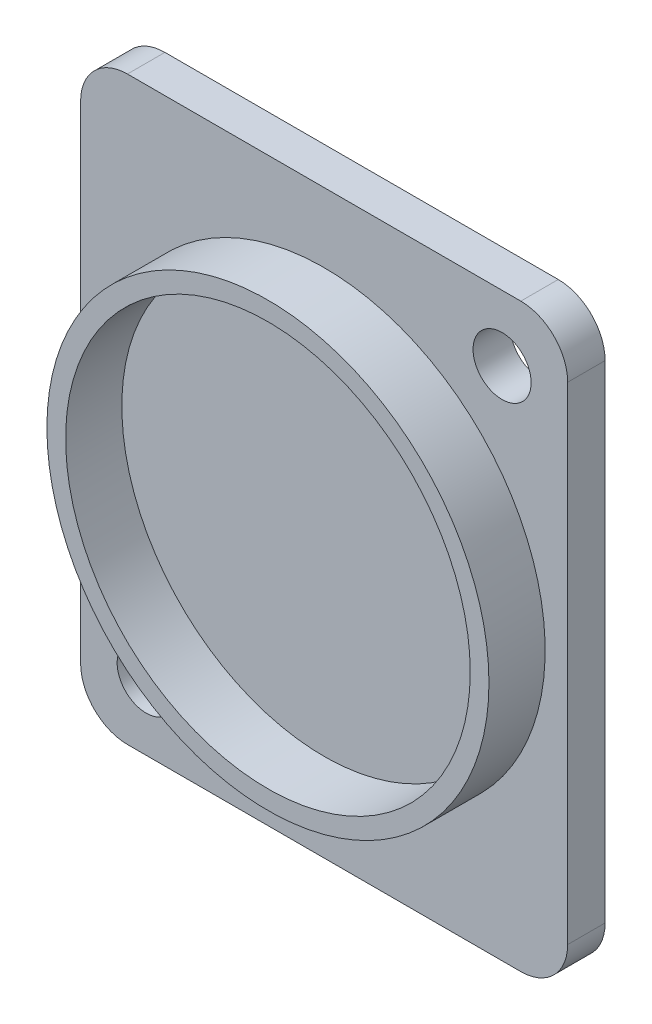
ISO-10303-21;
HEADER;
FILE_DESCRIPTION(('STEP AP214'),'2;1');
FILE_NAME('part.step','',(''),(''),'','','');
FILE_SCHEMA(('AUTOMOTIVE_DESIGN { 1 0 10303 214 1 1 1 1 }'));
ENDSEC;
DATA;
#1=APPLICATION_CONTEXT('core data for automotive mechanical design processes');
#2=APPLICATION_PROTOCOL_DEFINITION('international standard','automotive_design',2000,#1);
#3=PRODUCT_CONTEXT('',#1,'mechanical');
#4=PRODUCT('Part','Part','',(#3));
#5=PRODUCT_RELATED_PRODUCT_CATEGORY('part','',(#4));
#6=PRODUCT_DEFINITION_FORMATION('','',#4);
#7=PRODUCT_DEFINITION_CONTEXT('part definition',#1,'design');
#8=PRODUCT_DEFINITION('design','',#6,#7);
#9=PRODUCT_DEFINITION_SHAPE('','',#8);
#10=(LENGTH_UNIT() NAMED_UNIT(*) SI_UNIT(.MILLI.,.METRE.));
#11=(NAMED_UNIT(*) PLANE_ANGLE_UNIT() SI_UNIT($,.RADIAN.));
#12=(NAMED_UNIT(*) SI_UNIT($,.STERADIAN.) SOLID_ANGLE_UNIT());
#13=UNCERTAINTY_MEASURE_WITH_UNIT(LENGTH_MEASURE(1.E-05),#10,'distance_accuracy_value','');
#14=(GEOMETRIC_REPRESENTATION_CONTEXT(3) GLOBAL_UNCERTAINTY_ASSIGNED_CONTEXT((#13)) GLOBAL_UNIT_ASSIGNED_CONTEXT((#10,
#11,#12)) REPRESENTATION_CONTEXT('',''));
#15=CARTESIAN_POINT('',(0.,0.,0.));
#16=DIRECTION('',(0.,0.,1.));
#17=DIRECTION('',(1.,0.,0.));
#18=AXIS2_PLACEMENT_3D('',#15,#16,#17);
#19=CARTESIAN_POINT('',(-10.5,-13.,2.));
#20=DIRECTION('',(0.,0.,-1.));
#21=DIRECTION('',(-1.,0.,0.));
#22=AXIS2_PLACEMENT_3D('',#19,#20,#21);
#23=PLANE('',#22);
#24=CARTESIAN_POINT('',(9.5,12.,2.));
#25=DIRECTION('',(0.,0.,1.));
#26=DIRECTION('',(1.,0.,0.));
#27=AXIS2_PLACEMENT_3D('',#24,#25,#26);
#28=CIRCLE('',#27,1.55);
#29=CARTESIAN_POINT('',(11.05,12.,2.));
#30=VERTEX_POINT('',#29);
#31=EDGE_CURVE('E135',#30,#30,#28,.T.);
#32=ORIENTED_EDGE('',*,*,#31,.F.);
#33=EDGE_LOOP('',(#32));
#34=FACE_BOUND('',#33,.T.);
#35=CARTESIAN_POINT('',(-10.5,-13.,2.));
#36=DIRECTION('',(0.,0.,1.));
#37=DIRECTION('',(-1.,0.,0.));
#38=AXIS2_PLACEMENT_3D('',#35,#36,#37);
#39=CIRCLE('',#38,2.5);
#40=CARTESIAN_POINT('',(-13.,-13.,2.));
#41=VERTEX_POINT('',#40);
#42=CARTESIAN_POINT('',(-10.5,-15.5,2.));
#43=VERTEX_POINT('',#42);
#44=EDGE_CURVE('E146',#41,#43,#39,.T.);
#45=ORIENTED_EDGE('',*,*,#44,.T.);
#46=DIRECTION('',(1.,0.,0.));
#47=VECTOR('',#46,1.);
#48=CARTESIAN_POINT('',(10.5,-15.5,2.));
#49=LINE('',#48,#47);
#50=CARTESIAN_POINT('',(10.5,-15.5,2.));
#51=VERTEX_POINT('',#50);
#52=EDGE_CURVE('E94',#43,#51,#49,.T.);
#53=ORIENTED_EDGE('',*,*,#52,.T.);
#54=CARTESIAN_POINT('',(10.5,-13.,2.));
#55=DIRECTION('',(0.,0.,1.));
#56=DIRECTION('',(1.,0.,0.));
#57=AXIS2_PLACEMENT_3D('',#54,#55,#56);
#58=CIRCLE('',#57,2.5);
#59=CARTESIAN_POINT('',(13.,-13.,2.));
#60=VERTEX_POINT('',#59);
#61=EDGE_CURVE('E178',#51,#60,#58,.T.);
#62=ORIENTED_EDGE('',*,*,#61,.T.);
#63=DIRECTION('',(0.,1.,0.));
#64=VECTOR('',#63,1.);
#65=CARTESIAN_POINT('',(13.,-13.,2.));
#66=LINE('',#65,#64);
#67=CARTESIAN_POINT('',(13.,13.,2.));
#68=VERTEX_POINT('',#67);
#69=EDGE_CURVE('E177',#60,#68,#66,.T.);
#70=ORIENTED_EDGE('',*,*,#69,.T.);
#71=CARTESIAN_POINT('',(10.5,13.,2.));
#72=DIRECTION('',(0.,0.,1.));
#73=DIRECTION('',(1.,0.,0.));
#74=AXIS2_PLACEMENT_3D('',#71,#72,#73);
#75=CIRCLE('',#74,2.5);
#76=CARTESIAN_POINT('',(10.5,15.5,2.));
#77=VERTEX_POINT('',#76);
#78=EDGE_CURVE('E113',#68,#77,#75,.T.);
#79=ORIENTED_EDGE('',*,*,#78,.T.);
#80=DIRECTION('',(-1.,0.,0.));
#81=VECTOR('',#80,1.);
#82=CARTESIAN_POINT('',(10.5,15.5,2.));
#83=LINE('',#82,#81);
#84=CARTESIAN_POINT('',(-10.5,15.5,2.));
#85=VERTEX_POINT('',#84);
#86=EDGE_CURVE('E107',#77,#85,#83,.T.);
#87=ORIENTED_EDGE('',*,*,#86,.T.);
#88=CARTESIAN_POINT('',(-10.5,13.,2.));
#89=DIRECTION('',(0.,0.,1.));
#90=DIRECTION('',(1.,0.,0.));
#91=AXIS2_PLACEMENT_3D('',#88,#89,#90);
#92=CIRCLE('',#91,2.5);
#93=CARTESIAN_POINT('',(-13.,13.,2.));
#94=VERTEX_POINT('',#93);
#95=EDGE_CURVE('E111',#85,#94,#92,.T.);
#96=ORIENTED_EDGE('',*,*,#95,.T.);
#97=DIRECTION('',(0.,-1.,0.));
#98=VECTOR('',#97,1.);
#99=CARTESIAN_POINT('',(-13.,-13.,2.));
#100=LINE('',#99,#98);
#101=EDGE_CURVE('E50',#94,#41,#100,.T.);
#102=ORIENTED_EDGE('',*,*,#101,.T.);
#103=EDGE_LOOP('',(#45,#53,#62,#70,#79,#87,#96,#102));
#104=FACE_BOUND('',#103,.T.);
#105=CARTESIAN_POINT('',(-9.5,-12.,2.));
#106=DIRECTION('',(0.,0.,1.));
#107=DIRECTION('',(1.,0.,0.));
#108=AXIS2_PLACEMENT_3D('',#105,#106,#107);
#109=CIRCLE('',#108,1.55);
#110=CARTESIAN_POINT('',(-7.94999999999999,-12.,2.));
#111=VERTEX_POINT('',#110);
#112=EDGE_CURVE('E187',#111,#111,#109,.T.);
#113=ORIENTED_EDGE('',*,*,#112,.F.);
#114=EDGE_LOOP('',(#113));
#115=FACE_BOUND('',#114,.T.);
#116=CARTESIAN_POINT('',(0.,0.,2.));
#117=DIRECTION('',(0.,0.,-1.));
#118=DIRECTION('',(-1.,0.,0.));
#119=AXIS2_PLACEMENT_3D('',#116,#117,#118);
#120=CIRCLE('',#119,11.8);
#121=CARTESIAN_POINT('',(-11.8,0.,2.));
#122=VERTEX_POINT('',#121);
#123=EDGE_CURVE('E11',#122,#122,#120,.F.);
#124=ORIENTED_EDGE('',*,*,#123,.F.);
#125=EDGE_LOOP('',(#124));
#126=FACE_BOUND('',#125,.T.);
#127=ADVANCED_FACE('F33',(#34,#104,#115,#126),#23,.F.);
#128=CARTESIAN_POINT('',(-10.5,-13.,0.));
#129=DIRECTION('',(0.,0.,-1.));
#130=DIRECTION('',(-1.,0.,0.));
#131=AXIS2_PLACEMENT_3D('',#128,#129,#130);
#132=PLANE('',#131);
#133=CARTESIAN_POINT('',(9.5,12.,0.));
#134=DIRECTION('',(0.,0.,1.));
#135=DIRECTION('',(1.,0.,0.));
#136=AXIS2_PLACEMENT_3D('',#133,#134,#135);
#137=CIRCLE('',#136,1.55);
#138=CARTESIAN_POINT('',(11.05,12.,0.));
#139=VERTEX_POINT('',#138);
#140=EDGE_CURVE('E184',#139,#139,#137,.T.);
#141=ORIENTED_EDGE('',*,*,#140,.T.);
#142=EDGE_LOOP('',(#141));
#143=FACE_BOUND('',#142,.T.);
#144=CARTESIAN_POINT('',(-10.5,-13.,0.));
#145=DIRECTION('',(0.,0.,1.));
#146=DIRECTION('',(-1.,0.,0.));
#147=AXIS2_PLACEMENT_3D('',#144,#145,#146);
#148=CIRCLE('',#147,2.5);
#149=CARTESIAN_POINT('',(-13.,-13.,0.));
#150=VERTEX_POINT('',#149);
#151=CARTESIAN_POINT('',(-10.5,-15.5,0.));
#152=VERTEX_POINT('',#151);
#153=EDGE_CURVE('E131',#150,#152,#148,.T.);
#154=ORIENTED_EDGE('',*,*,#153,.F.);
#155=DIRECTION('',(0.,-1.,0.));
#156=VECTOR('',#155,1.);
#157=CARTESIAN_POINT('',(-13.,-13.,0.));
#158=LINE('',#157,#156);
#159=CARTESIAN_POINT('',(-13.,13.,0.));
#160=VERTEX_POINT('',#159);
#161=EDGE_CURVE('E85',#160,#150,#158,.T.);
#162=ORIENTED_EDGE('',*,*,#161,.F.);
#163=CARTESIAN_POINT('',(-10.5,13.,0.));
#164=DIRECTION('',(0.,0.,1.));
#165=DIRECTION('',(1.,0.,0.));
#166=AXIS2_PLACEMENT_3D('',#163,#164,#165);
#167=CIRCLE('',#166,2.5);
#168=CARTESIAN_POINT('',(-10.5,15.5,0.));
#169=VERTEX_POINT('',#168);
#170=EDGE_CURVE('E79',#169,#160,#167,.T.);
#171=ORIENTED_EDGE('',*,*,#170,.F.);
#172=DIRECTION('',(-1.,0.,0.));
#173=VECTOR('',#172,1.);
#174=CARTESIAN_POINT('',(10.5,15.5,0.));
#175=LINE('',#174,#173);
#176=CARTESIAN_POINT('',(10.5,15.5,0.));
#177=VERTEX_POINT('',#176);
#178=EDGE_CURVE('E121',#177,#169,#175,.T.);
#179=ORIENTED_EDGE('',*,*,#178,.F.);
#180=CARTESIAN_POINT('',(10.5,13.,0.));
#181=DIRECTION('',(0.,0.,1.));
#182=DIRECTION('',(1.,0.,0.));
#183=AXIS2_PLACEMENT_3D('',#180,#181,#182);
#184=CIRCLE('',#183,2.5);
#185=CARTESIAN_POINT('',(13.,13.,0.));
#186=VERTEX_POINT('',#185);
#187=EDGE_CURVE('E141',#186,#177,#184,.T.);
#188=ORIENTED_EDGE('',*,*,#187,.F.);
#189=DIRECTION('',(0.,1.,0.));
#190=VECTOR('',#189,1.);
#191=CARTESIAN_POINT('',(13.,-13.,0.));
#192=LINE('',#191,#190);
#193=CARTESIAN_POINT('',(13.,-13.,0.));
#194=VERTEX_POINT('',#193);
#195=EDGE_CURVE('E139',#194,#186,#192,.T.);
#196=ORIENTED_EDGE('',*,*,#195,.F.);
#197=CARTESIAN_POINT('',(10.5,-13.,0.));
#198=DIRECTION('',(0.,0.,1.));
#199=DIRECTION('',(1.,0.,0.));
#200=AXIS2_PLACEMENT_3D('',#197,#198,#199);
#201=CIRCLE('',#200,2.5);
#202=CARTESIAN_POINT('',(10.5,-15.5,0.));
#203=VERTEX_POINT('',#202);
#204=EDGE_CURVE('E137',#203,#194,#201,.T.);
#205=ORIENTED_EDGE('',*,*,#204,.F.);
#206=DIRECTION('',(1.,0.,0.));
#207=VECTOR('',#206,1.);
#208=CARTESIAN_POINT('',(10.5,-15.5,0.));
#209=LINE('',#208,#207);
#210=EDGE_CURVE('E134',#152,#203,#209,.T.);
#211=ORIENTED_EDGE('',*,*,#210,.F.);
#212=EDGE_LOOP('',(#154,#162,#171,#179,#188,#196,#205,#211));
#213=FACE_BOUND('',#212,.T.);
#214=CARTESIAN_POINT('',(-9.5,-12.,0.));
#215=DIRECTION('',(0.,0.,1.));
#216=DIRECTION('',(1.,0.,0.));
#217=AXIS2_PLACEMENT_3D('',#214,#215,#216);
#218=CIRCLE('',#217,1.55);
#219=CARTESIAN_POINT('',(-7.94999999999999,-12.,0.));
#220=VERTEX_POINT('',#219);
#221=EDGE_CURVE('E190',#220,#220,#218,.T.);
#222=ORIENTED_EDGE('',*,*,#221,.T.);
#223=EDGE_LOOP('',(#222));
#224=FACE_BOUND('',#223,.T.);
#225=ADVANCED_FACE('F164',(#143,#213,#224),#132,.T.);
#226=CARTESIAN_POINT('',(-10.5,-13.,2.));
#227=DIRECTION('',(0.,0.,-1.));
#228=DIRECTION('',(-1.,0.,0.));
#229=AXIS2_PLACEMENT_3D('',#226,#227,#228);
#230=CYLINDRICAL_SURFACE('',#229,2.5);
#231=ORIENTED_EDGE('',*,*,#153,.T.);
#232=DIRECTION('',(0.,0.,-1.));
#233=VECTOR('',#232,1.);
#234=CARTESIAN_POINT('',(-10.5,-15.5,2.));
#235=LINE('',#234,#233);
#236=EDGE_CURVE('E42',#43,#152,#235,.T.);
#237=ORIENTED_EDGE('',*,*,#236,.F.);
#238=ORIENTED_EDGE('',*,*,#44,.F.);
#239=DIRECTION('',(0.,0.,-1.));
#240=VECTOR('',#239,1.);
#241=CARTESIAN_POINT('',(-13.,-13.,2.));
#242=LINE('',#241,#240);
#243=EDGE_CURVE('E127',#41,#150,#242,.T.);
#244=ORIENTED_EDGE('',*,*,#243,.T.);
#245=EDGE_LOOP('',(#231,#237,#238,#244));
#246=FACE_BOUND('',#245,.T.);
#247=ADVANCED_FACE('F35',(#246),#230,.T.);
#248=CARTESIAN_POINT('',(10.5,-15.5,2.));
#249=DIRECTION('',(0.,1.,0.));
#250=DIRECTION('',(-1.,0.,0.));
#251=AXIS2_PLACEMENT_3D('',#248,#249,#250);
#252=PLANE('',#251);
#253=ORIENTED_EDGE('',*,*,#210,.T.);
#254=DIRECTION('',(0.,0.,-1.));
#255=VECTOR('',#254,1.);
#256=CARTESIAN_POINT('',(10.5,-15.5,2.));
#257=LINE('',#256,#255);
#258=EDGE_CURVE('E156',#51,#203,#257,.T.);
#259=ORIENTED_EDGE('',*,*,#258,.F.);
#260=ORIENTED_EDGE('',*,*,#52,.F.);
#261=ORIENTED_EDGE('',*,*,#236,.T.);
#262=EDGE_LOOP('',(#253,#259,#260,#261));
#263=FACE_BOUND('',#262,.T.);
#264=ADVANCED_FACE('F159',(#263),#252,.F.);
#265=CARTESIAN_POINT('',(10.5,-13.,2.));
#266=DIRECTION('',(0.,0.,-1.));
#267=DIRECTION('',(-1.,0.,0.));
#268=AXIS2_PLACEMENT_3D('',#265,#266,#267);
#269=CYLINDRICAL_SURFACE('',#268,2.5);
#270=ORIENTED_EDGE('',*,*,#204,.T.);
#271=DIRECTION('',(0.,0.,-1.));
#272=VECTOR('',#271,1.);
#273=CARTESIAN_POINT('',(13.,-13.,2.));
#274=LINE('',#273,#272);
#275=EDGE_CURVE('E153',#60,#194,#274,.T.);
#276=ORIENTED_EDGE('',*,*,#275,.F.);
#277=ORIENTED_EDGE('',*,*,#61,.F.);
#278=ORIENTED_EDGE('',*,*,#258,.T.);
#279=EDGE_LOOP('',(#270,#276,#277,#278));
#280=FACE_BOUND('',#279,.T.);
#281=ADVANCED_FACE('F171',(#280),#269,.T.);
#282=CARTESIAN_POINT('',(13.,-13.,2.));
#283=DIRECTION('',(-1.,0.,0.));
#284=DIRECTION('',(0.,0.,1.));
#285=AXIS2_PLACEMENT_3D('',#282,#283,#284);
#286=PLANE('',#285);
#287=ORIENTED_EDGE('',*,*,#195,.T.);
#288=DIRECTION('',(0.,0.,-1.));
#289=VECTOR('',#288,1.);
#290=CARTESIAN_POINT('',(13.,13.,2.));
#291=LINE('',#290,#289);
#292=EDGE_CURVE('E150',#68,#186,#291,.T.);
#293=ORIENTED_EDGE('',*,*,#292,.F.);
#294=ORIENTED_EDGE('',*,*,#69,.F.);
#295=ORIENTED_EDGE('',*,*,#275,.T.);
#296=EDGE_LOOP('',(#287,#293,#294,#295));
#297=FACE_BOUND('',#296,.T.);
#298=ADVANCED_FACE('F175',(#297),#286,.F.);
#299=CARTESIAN_POINT('',(10.5,13.,2.));
#300=DIRECTION('',(0.,0.,-1.));
#301=DIRECTION('',(-1.,0.,0.));
#302=AXIS2_PLACEMENT_3D('',#299,#300,#301);
#303=CYLINDRICAL_SURFACE('',#302,2.5);
#304=ORIENTED_EDGE('',*,*,#187,.T.);
#305=DIRECTION('',(0.,0.,-1.));
#306=VECTOR('',#305,1.);
#307=CARTESIAN_POINT('',(10.5,15.5,2.));
#308=LINE('',#307,#306);
#309=EDGE_CURVE('E122',#77,#177,#308,.T.);
#310=ORIENTED_EDGE('',*,*,#309,.F.);
#311=ORIENTED_EDGE('',*,*,#78,.F.);
#312=ORIENTED_EDGE('',*,*,#292,.T.);
#313=EDGE_LOOP('',(#304,#310,#311,#312));
#314=FACE_BOUND('',#313,.T.);
#315=ADVANCED_FACE('F295',(#314),#303,.T.);
#316=CARTESIAN_POINT('',(10.5,15.5,2.));
#317=DIRECTION('',(0.,-1.,0.));
#318=DIRECTION('',(0.,0.,-1.));
#319=AXIS2_PLACEMENT_3D('',#316,#317,#318);
#320=PLANE('',#319);
#321=ORIENTED_EDGE('',*,*,#178,.T.);
#322=DIRECTION('',(0.,0.,-1.));
#323=VECTOR('',#322,1.);
#324=CARTESIAN_POINT('',(-10.5,15.5,2.));
#325=LINE('',#324,#323);
#326=EDGE_CURVE('E118',#85,#169,#325,.T.);
#327=ORIENTED_EDGE('',*,*,#326,.F.);
#328=ORIENTED_EDGE('',*,*,#86,.F.);
#329=ORIENTED_EDGE('',*,*,#309,.T.);
#330=EDGE_LOOP('',(#321,#327,#328,#329));
#331=FACE_BOUND('',#330,.T.);
#332=ADVANCED_FACE('F119',(#331),#320,.F.);
#333=CARTESIAN_POINT('',(-10.5,13.,2.));
#334=DIRECTION('',(0.,0.,-1.));
#335=DIRECTION('',(-1.,0.,0.));
#336=AXIS2_PLACEMENT_3D('',#333,#334,#335);
#337=CYLINDRICAL_SURFACE('',#336,2.5);
#338=ORIENTED_EDGE('',*,*,#170,.T.);
#339=DIRECTION('',(0.,0.,-1.));
#340=VECTOR('',#339,1.);
#341=CARTESIAN_POINT('',(-13.,13.,2.));
#342=LINE('',#341,#340);
#343=EDGE_CURVE('E123',#94,#160,#342,.T.);
#344=ORIENTED_EDGE('',*,*,#343,.F.);
#345=ORIENTED_EDGE('',*,*,#95,.F.);
#346=ORIENTED_EDGE('',*,*,#326,.T.);
#347=EDGE_LOOP('',(#338,#344,#345,#346));
#348=FACE_BOUND('',#347,.T.);
#349=ADVANCED_FACE('F125',(#348),#337,.T.);
#350=CARTESIAN_POINT('',(-13.,-13.,2.));
#351=DIRECTION('',(1.,0.,0.));
#352=DIRECTION('',(0.,0.,-1.));
#353=AXIS2_PLACEMENT_3D('',#350,#351,#352);
#354=PLANE('',#353);
#355=ORIENTED_EDGE('',*,*,#161,.T.);
#356=ORIENTED_EDGE('',*,*,#243,.F.);
#357=ORIENTED_EDGE('',*,*,#101,.F.);
#358=ORIENTED_EDGE('',*,*,#343,.T.);
#359=EDGE_LOOP('',(#355,#356,#357,#358));
#360=FACE_BOUND('',#359,.T.);
#361=ADVANCED_FACE('F270',(#360),#354,.F.);
#362=CARTESIAN_POINT('',(9.5,12.,2.));
#363=DIRECTION('',(0.,0.,-1.));
#364=DIRECTION('',(-1.,0.,0.));
#365=AXIS2_PLACEMENT_3D('',#362,#363,#364);
#366=CYLINDRICAL_SURFACE('',#365,1.55);
#367=ORIENTED_EDGE('',*,*,#31,.T.);
#368=EDGE_LOOP('',(#367));
#369=FACE_BOUND('',#368,.T.);
#370=ORIENTED_EDGE('',*,*,#140,.F.);
#371=EDGE_LOOP('',(#370));
#372=FACE_BOUND('',#371,.T.);
#373=ADVANCED_FACE('F220',(#369,#372),#366,.F.);
#374=CARTESIAN_POINT('',(-9.5,-12.,2.));
#375=DIRECTION('',(0.,0.,-1.));
#376=DIRECTION('',(-1.,0.,0.));
#377=AXIS2_PLACEMENT_3D('',#374,#375,#376);
#378=CYLINDRICAL_SURFACE('',#377,1.55);
#379=ORIENTED_EDGE('',*,*,#112,.T.);
#380=EDGE_LOOP('',(#379));
#381=FACE_BOUND('',#380,.T.);
#382=ORIENTED_EDGE('',*,*,#221,.F.);
#383=EDGE_LOOP('',(#382));
#384=FACE_BOUND('',#383,.T.);
#385=ADVANCED_FACE('F211',(#381,#384),#378,.F.);
#386=CARTESIAN_POINT('',(0.,0.,5.));
#387=DIRECTION('',(0.,0.,1.));
#388=DIRECTION('',(1.,0.,0.));
#389=AXIS2_PLACEMENT_3D('',#386,#387,#388);
#390=PLANE('',#389);
#391=CARTESIAN_POINT('',(0.,0.,5.));
#392=DIRECTION('',(0.,0.,1.));
#393=DIRECTION('',(1.,0.,0.));
#394=AXIS2_PLACEMENT_3D('',#391,#392,#393);
#395=CIRCLE('',#394,11.8);
#396=CARTESIAN_POINT('',(11.8,0.,5.));
#397=VERTEX_POINT('',#396);
#398=EDGE_CURVE('E193',#397,#397,#395,.T.);
#399=ORIENTED_EDGE('',*,*,#398,.T.);
#400=EDGE_LOOP('',(#399));
#401=FACE_BOUND('',#400,.T.);
#402=CARTESIAN_POINT('',(0.,0.,5.));
#403=DIRECTION('',(0.,0.,1.));
#404=DIRECTION('',(1.,0.,0.));
#405=AXIS2_PLACEMENT_3D('',#402,#403,#404);
#406=CIRCLE('',#405,10.8);
#407=CARTESIAN_POINT('',(10.8,0.,5.));
#408=VERTEX_POINT('',#407);
#409=EDGE_CURVE('E198',#408,#408,#406,.T.);
#410=ORIENTED_EDGE('',*,*,#409,.F.);
#411=EDGE_LOOP('',(#410));
#412=FACE_BOUND('',#411,.T.);
#413=ADVANCED_FACE('F208',(#401,#412),#390,.T.);
#414=CARTESIAN_POINT('',(0.,0.,5.));
#415=DIRECTION('',(0.,0.,-1.));
#416=DIRECTION('',(-1.,0.,0.));
#417=AXIS2_PLACEMENT_3D('',#414,#415,#416);
#418=CYLINDRICAL_SURFACE('',#417,11.8);
#419=ORIENTED_EDGE('',*,*,#398,.F.);
#420=EDGE_LOOP('',(#419));
#421=FACE_BOUND('',#420,.T.);
#422=ORIENTED_EDGE('',*,*,#123,.T.);
#423=EDGE_LOOP('',(#422));
#424=FACE_BOUND('',#423,.T.);
#425=ADVANCED_FACE('F210',(#421,#424),#418,.T.);
#426=CARTESIAN_POINT('',(0.,0.,5.));
#427=DIRECTION('',(0.,0.,-1.));
#428=DIRECTION('',(-1.,0.,0.));
#429=AXIS2_PLACEMENT_3D('',#426,#427,#428);
#430=CYLINDRICAL_SURFACE('',#429,10.8);
#431=ORIENTED_EDGE('',*,*,#409,.T.);
#432=EDGE_LOOP('',(#431));
#433=FACE_BOUND('',#432,.T.);
#434=CARTESIAN_POINT('',(0.,0.,2.));
#435=DIRECTION('',(0.,0.,1.));
#436=DIRECTION('',(1.,0.,0.));
#437=AXIS2_PLACEMENT_3D('',#434,#435,#436);
#438=CIRCLE('',#437,10.8);
#439=CARTESIAN_POINT('',(10.8,0.,2.));
#440=VERTEX_POINT('',#439);
#441=EDGE_CURVE('E199',#440,#440,#438,.T.);
#442=ORIENTED_EDGE('',*,*,#441,.F.);
#443=EDGE_LOOP('',(#442));
#444=FACE_BOUND('',#443,.T.);
#445=ADVANCED_FACE('F205',(#433,#444),#430,.F.);
#446=ORIENTED_EDGE('',*,*,#441,.T.);
#447=EDGE_LOOP('',(#446));
#448=FACE_BOUND('',#447,.T.);
#449=ADVANCED_FACE('F227',(#448),#23,.F.);
#450=CLOSED_SHELL('',(#127,#225,#247,#264,#281,#298,#315,#332,#349,#361,#373,#385,#413,#425,
#445,#449));
#451=MANIFOLD_SOLID_BREP('B2',#450);
#452=ADVANCED_BREP_SHAPE_REPRESENTATION('',(#18,#451),#14);
#453=SHAPE_DEFINITION_REPRESENTATION(#9,#452);
ENDSEC;
END-ISO-10303-21;
